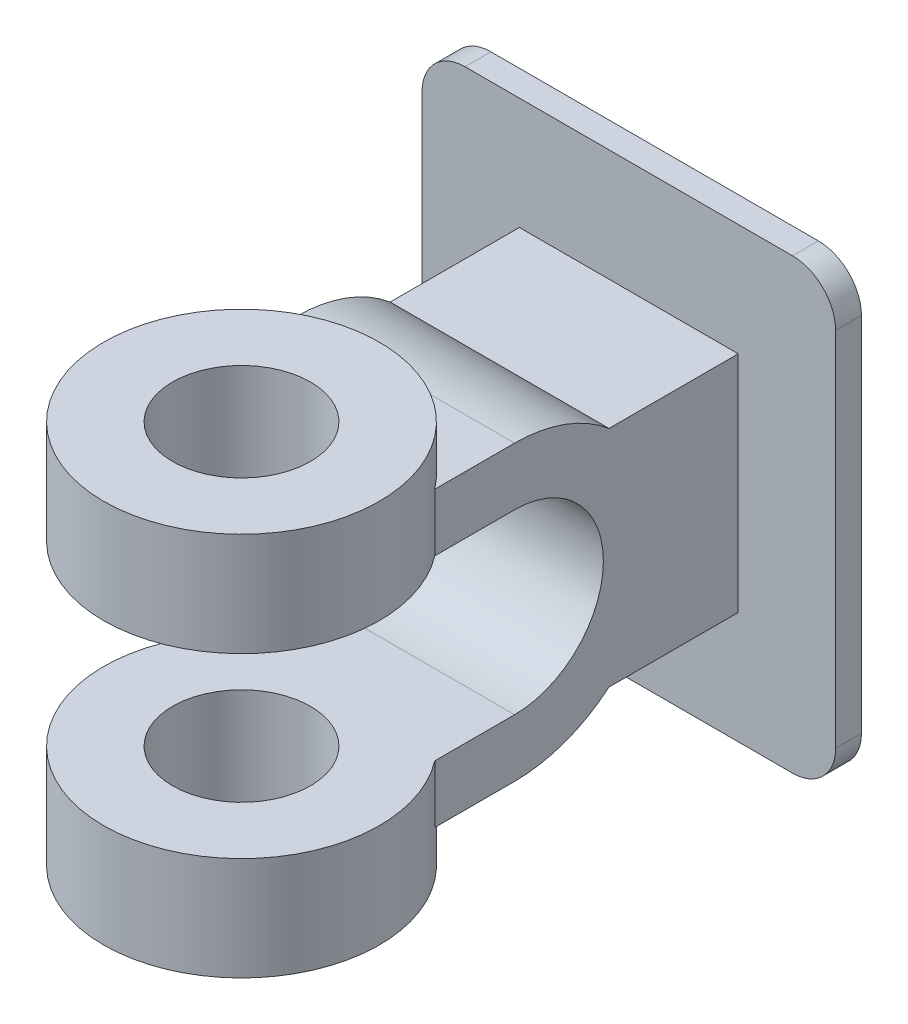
from build123d import *

# Parameters (mm, degrees)
BOSS_EXTRUDE1_DEPTH = 12.7
SKETCH2_R           = 16
BOSS_EXTRUDE2_DEPTH = 12
SKETCH3_R           = 8
CUT_EXTRUDE1_DEPTH  = 26
SKETCH4_W           = 48
SKETCH4_H           = 52
BOSS_EXTRUDE3_DEPTH = 3
FILLET1_R           = 5
SCALE1_SCALE        = 0.7
SCALE2_SCALE        = 0.5
SCALE3_SCALE        = 1.25


with BuildPart() as part:
    # Sketch1 → Boss-Extrude1 (new, symmetric)
    with BuildSketch(Plane(origin=(0, 0, 0), x_dir=(0, 0, -1), z_dir=(1, 0, 0))):
        with BuildLine():
            Line((10.95445115, 13), (25.95445115, 13))
            Line((25.95445115, 13), (25.95445115, -13))
            Line((25.95445115, -13), (10.95445115, -13))
            ThreePointArc((10.95445115, -13), (5.830951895, -15.968719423), (0, -17))
            Line((0, -17), (-19, -17))
            Line((-19, -17), (-19, -10.3))
            Line((-19, -10.3), (0, -10.3))
            ThreePointArc((0, -10.3), (10.3, 0), (0, 10.3))
            Line((0, 10.3), (-19, 10.3))
            Line((-19, 10.3), (-19, 17))
            Line((-19, 17), (0, 17))
            ThreePointArc((0, 17), (5.830951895, 15.968719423), (10.95445115, 13))
        make_face()
    extrude(amount=BOSS_EXTRUDE1_DEPTH, both=True)

    # Sketch2 → Boss-Extrude2 (add)
    with BuildSketch(Plane(origin=(0, -10.3, 0), x_dir=(1, 0, 0), z_dir=(0, 1, 0))):
        with Locations(Location((0, -19, 0), (0, 0, 270))):
            Circle(SKETCH2_R)
    boss_extrude2 = extrude(amount=-BOSS_EXTRUDE2_DEPTH)

    # Sketch3 → Cut-Extrude1 (cut)
    with BuildSketch(Plane(origin=(0, -10.3, 0), x_dir=(1, 0, 0), z_dir=(0, 1, 0))):
        with Locations(Location((0, -19, 0), (0, 0, 270))):
            Circle(SKETCH3_R)
    cut_extrude1 = extrude(amount=-CUT_EXTRUDE1_DEPTH, mode=Mode.SUBTRACT)

    # Mirror2: Boss-Extrude2, Cut-Extrude1 across plane
    add(boss_extrude2.mirror(Plane.ZX))
    add(cut_extrude1.mirror(Plane.ZX), mode=Mode.SUBTRACT)

    # Sketch4 → Boss-Extrude3 (add)
    with BuildSketch(Plane(origin=(0, 0, -25.95445115), x_dir=(-1, 0, 0), z_dir=(0, 0, -1))):
        Rectangle(SKETCH4_W, SKETCH4_H)
    extrude(amount=BOSS_EXTRUDE3_DEPTH)

    # Fillet1
    fillet1_edges = [part.edges().sort_by_distance(p)[0] for p in [
        (-24, -26, -27.45445115),
        (-24, 26, -27.45445115),
        (24, 26, -27.45445115),
        (24, -26, -27.45445115),
    ]]
    fillet(fillet1_edges, radius=FILLET1_R)


with BuildPart() as part_1:
    # Scale1: scaled about (0, 0, -3.538207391)
    add(part.part.scale(SCALE1_SCALE).moved(Location((0, 0, -1.061462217))))


with BuildPart() as part_2:
    # Scale2: scaled about (0, 0, -3.538207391)
    add(part_1.part.scale(SCALE2_SCALE).moved(Location((0, 0, -1.769103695))))


with BuildPart() as part_3:
    # Scale3: scaled about (0, 0, -3.538207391)
    add(part_2.part.scale(SCALE3_SCALE).moved(Location((0, 0, 0.884551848))))


solid = part_3.part
